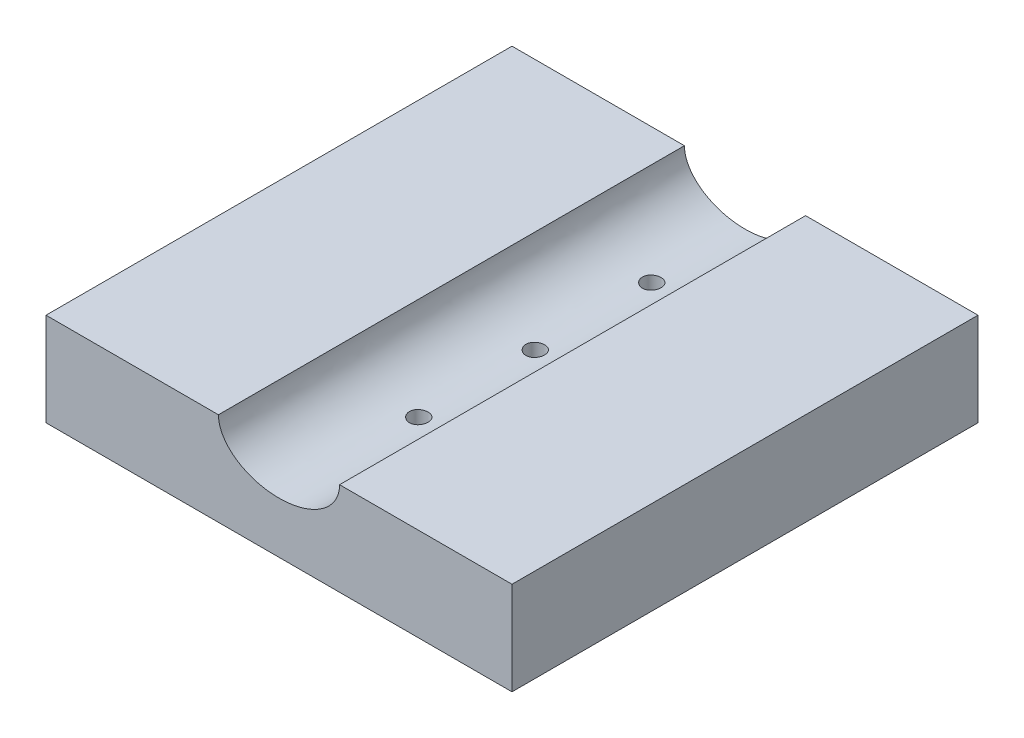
from build123d import *

# Parameters (mm, degrees)
EXTRUDE_1_DEPTH        = 100
SKETCH_2_R             = 2
CUT_EXTRUDE_1_DEPTH    = 114.578167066
PATTERN_LINEAR_1_COUNT = 3
PATTERN_LINEAR_1_PITCH = 25


with BuildPart() as part:
    # Sketch 1 → Extrude 1 (new body)
    with BuildSketch(Plane.XY):
        with BuildLine():
            Line((50, -20), (-50, -20))
            Line((-50, -20), (-50, 0))
            Line((-50, 0), (-13, 0))
            add(Edge.make_bspline(
                [(-13, 0), (-13, -9), (0, -9), (13, -9), (13, 0)],
                knots=[3.141592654, 3.141592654, 3.141592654, 4.71238898, 4.71238898, 6.283185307, 6.283185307, 6.283185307], degree=2, weights=[1, 0.707106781, 1, 0.707106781, 1]))
            Line((13, 0), (50, 0))
            Line((50, 0), (50, -20))
        make_face()
    extrude(amount=EXTRUDE_1_DEPTH)

    # Sketch 2 → Cut-Extrude 1 (cut, through all)
    with BuildSketch(Plane(origin=(0, 0, 0), x_dir=(1, 0, 0), z_dir=(0, 1, 0))):
        with Locations(Location((0, -20, 0), (0, 0, 270))):
            Circle(SKETCH_2_R)
    cut_extrude_1 = extrude(amount=-CUT_EXTRUDE_1_DEPTH, mode=Mode.SUBTRACT)

    # Pattern Linear 1: Cut-Extrude 1 ×3
    with Locations(*[(0, 0, i * PATTERN_LINEAR_1_PITCH) for i in range(1, PATTERN_LINEAR_1_COUNT)]):
        add(cut_extrude_1, mode=Mode.SUBTRACT)


solid = part.part
